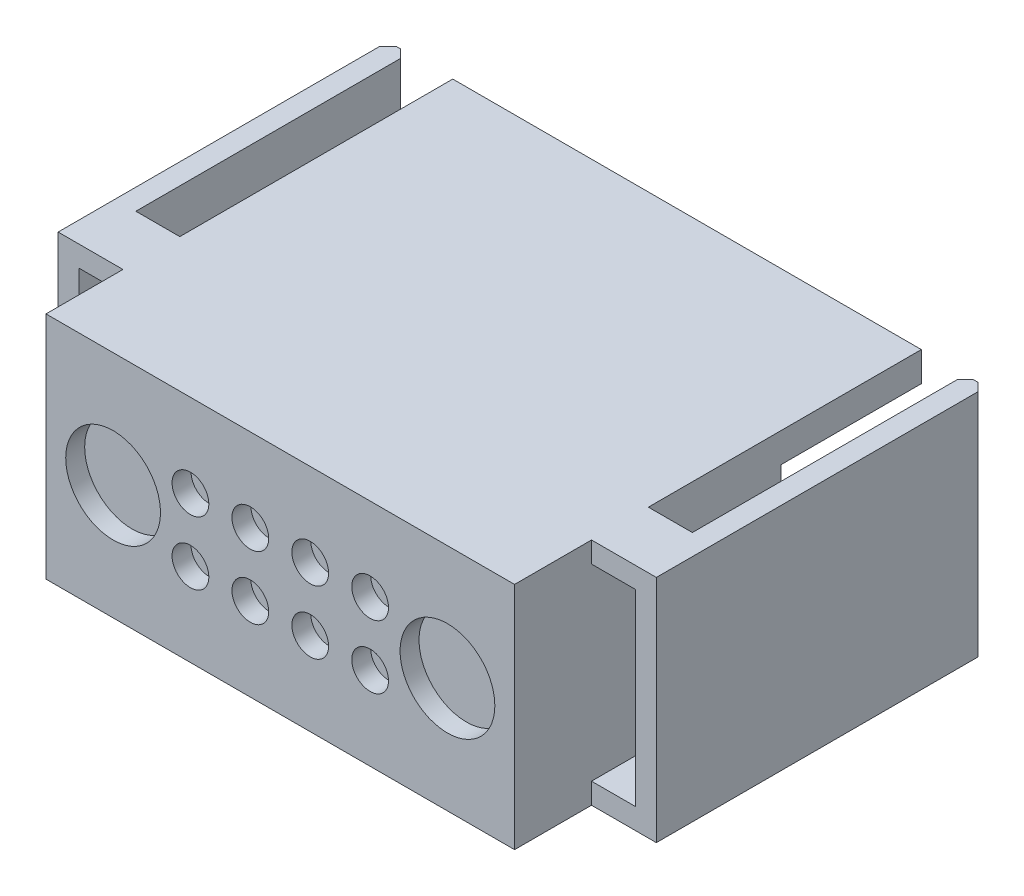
from build123d import *

# Parameters (mm, degrees)
EXTRUDE1_DEPTH     = 7.6962
SKETCH2_W          = 2.9464
SKETCH2_H          = 12.5984
CUT_EXTRUDE1_DEPTH = 3.81
EXTRUDE2_DEPTH     = 9.398
EXTRUDE3_DEPTH     = 15.3924
SKETCH5_R          = 2.6416
SKETCH5_R_2        = 1.2954
CUT_EXTRUDE2_DEPTH = 1.27
SKETCH6_R          = 3.175
SKETCH6_R_2        = 1.2319
CUT_EXTRUDE3_DEPTH = 1.27


with BuildPart() as part:
    # Sketch1 → Extrude1 (new, symmetric)
    with BuildSketch(Plane(origin=(0, 0, 0), x_dir=(1, 0, 0), z_dir=(0, 1, 0))):
        Polygon((15.6972, 0), (-15.6972, 0), (-15.6972, 5.1562), (-20.0406, 5.1562), (-20.0406, 17.8562), (-18.6436, 17.8562), (-18.6436, 8.9662), (-15.6972, 8.9662), (-15.6972, 17.8562), (15.6972, 17.8562), (15.6972, 8.9662), (18.6436, 8.9662), (18.6436, 17.8562), (20.0406, 17.8562), (20.0406, 5.1562), (15.6972, 5.1562), align=None)
    extrude(amount=EXTRUDE1_DEPTH, both=True)

    # Sketch2 → Cut-Extrude1 (cut)
    with BuildSketch(Plane(origin=(0, 0, -8.9662), x_dir=(-1, 0, 0), z_dir=(0, 0, -1))):
        with Locations((17.1704, 0)):
            Rectangle(SKETCH2_W, SKETCH2_H)
        with Locations((-17.1704, 0)):
            Rectangle(SKETCH2_W, SKETCH2_H)
    extrude(amount=-CUT_EXTRUDE1_DEPTH, mode=Mode.SUBTRACT)

    # Sketch3 → Extrude2 (add)
    with BuildSketch(Plane(origin=(0, 0, -17.8562), x_dir=(-1, 0, 0), z_dir=(0, 0, -1))):
        Polygon((15.6972, 5.715), (1.397, 5.715), (0, 4.318), (-1.397, 5.715), (-15.6972, 5.715), (-15.6972, 7.6962), (15.6972, 7.6962), align=None)
        Polygon((-15.6972, -3.937), (-13.9192, -5.715), (13.9192, -5.715), (15.6972, -3.937), (15.6972, -7.6962), (-15.6972, -7.6962), align=None)
    extrude(amount=EXTRUDE2_DEPTH)

    # Sketch4 → Extrude3 (add)
    with BuildSketch(Plane(origin=(0, 7.6962, 0), x_dir=(1, 0, 0), z_dir=(0, 1, 0))):
        Polygon((-20.0406, 17.8562), (-18.6436, 17.8562), (-18.6436, 26.7081), (-19.1897, 27.2542), (-19.4945, 27.2542), (-20.0406, 26.7081), align=None)
        Polygon((19.1897, 27.2542), (18.6436, 26.7081), (18.6436, 17.8562), (20.0406, 17.8562), (20.0406, 26.7081), (19.4945, 27.2542), align=None)
    extrude(amount=-EXTRUDE3_DEPTH)

    # Sketch5 → Cut-Extrude2 (cut)
    with BuildSketch(Plane(origin=(0, 0, -17.8562), x_dir=(-1, 0, 0), z_dir=(0, 0, -1))):
        with Locations((11.2014, 0)):
            Circle(SKETCH5_R)
        with Locations(Location((-11.2014, 0, 0), (0, 0, 180))):
            Circle(SKETCH5_R)
        with Locations((-6.0198, 2.1209)):
            Circle(SKETCH5_R_2)
        with Locations((-2.0066, 2.1209)):
            Circle(SKETCH5_R_2)
        with Locations((2.0066, 2.1209)):
            Circle(SKETCH5_R_2)
        with Locations((6.0198, 2.1209)):
            Circle(SKETCH5_R_2)
        with Locations((-6.0198, -2.1209)):
            Circle(SKETCH5_R_2)
        with Locations((-2.0066, -2.1209)):
            Circle(SKETCH5_R_2)
        with Locations((2.0066, -2.1209)):
            Circle(SKETCH5_R_2)
        with Locations((6.0198, -2.1209)):
            Circle(SKETCH5_R_2)
    extrude(amount=-CUT_EXTRUDE2_DEPTH, mode=Mode.SUBTRACT)

    # Sketch6 → Cut-Extrude3 (cut)
    with BuildSketch(Plane.XY):
        with Locations((11.2014, 0)):
            Circle(SKETCH6_R)
        with Locations(Location((-11.2014, 0, 0), (0, 0, 180))):
            Circle(SKETCH6_R)
        with Locations((6.0198, 2.1209)):
            Circle(SKETCH6_R_2)
        with Locations((2.0066, 2.1209)):
            Circle(SKETCH6_R_2)
        with Locations((-2.0066, 2.1209)):
            Circle(SKETCH6_R_2)
        with Locations((-6.0198, 2.1209)):
            Circle(SKETCH6_R_2)
        with Locations((6.0198, -2.1209)):
            Circle(SKETCH6_R_2)
        with Locations((2.0066, -2.1209)):
            Circle(SKETCH6_R_2)
        with Locations((-2.0066, -2.1209)):
            Circle(SKETCH6_R_2)
        with Locations((-6.0198, -2.1209)):
            Circle(SKETCH6_R_2)
    extrude(amount=-CUT_EXTRUDE3_DEPTH, mode=Mode.SUBTRACT)


solid = part.part
